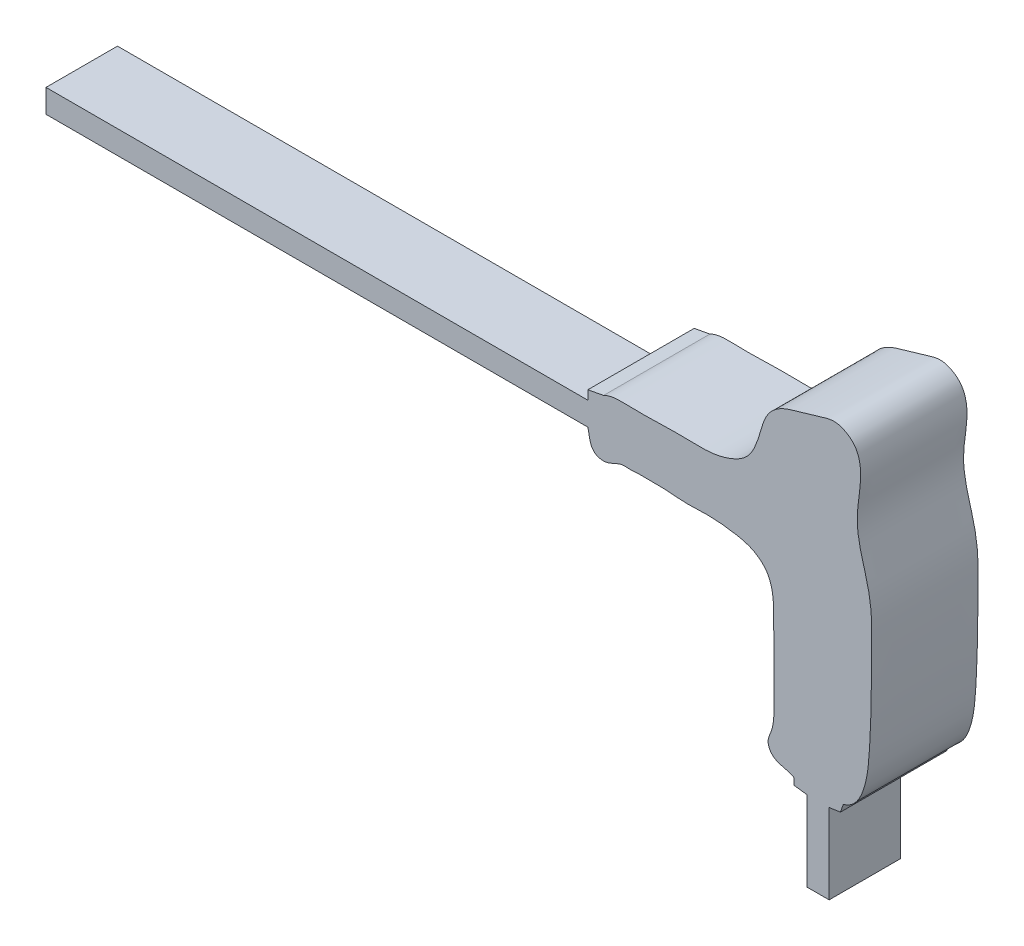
from build123d import *

# Parameters (mm, degrees)
BOSS_EXTRU_1_DEPTH      = 8.7
BOSS_EXTRU_1_DEPTH_BACK = 8.7
ESQUISSE2_W             = 3.624779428
ESQUISSE2_H             = 13.099889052
ESQUISSE2_W_2           = 88.693828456
ESQUISSE2_H_2           = 3.819311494
ENL_V_MAT_EXTRU_1_DEPTH = 5.7


with BuildPart() as part:
    # Esquisse1 → Boss.-Extru.1 (new, two sides: drawn at the far end of the back side and taken through both)
    with BuildSketch(Plane.XY.offset(-BOSS_EXTRU_1_DEPTH_BACK)):
        with BuildLine():
            Line((93.046595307, 50.808263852), (4.352766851, 50.808263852))
            Line((4.352766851, 50.808263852), (4.352766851, 46.988952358))
            Line((4.352766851, 46.988952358), (93.046595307, 46.988952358))
            add(Edge.make_bspline(
                [(93.046595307, 46.988952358), (93.247433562, 46.073835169), (93.333303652, 43.952970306), (95.69952302, 43.294273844), (97.174486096, 43.894564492), (98.517105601, 44.583492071), (99.797251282, 44.411384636), (101.264185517, 44.566123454), (103.261635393, 44.478969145), (105.9365003, 44.561998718), (108.675461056, 44.184987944), (111.422540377, 44.352638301), (114.114693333, 44.349958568), (117.004597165, 43.989657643), (120.078216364, 43.347813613), (122.538705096, 41.365078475), (123.37457678, 38.527598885), (123.511262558, 35.528978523), (123.401119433, 32.548113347), (123.583566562, 29.80194466), (123.486814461, 27.799935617), (123.514838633, 25.850858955), (123.524766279, 23.676108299), (123.544853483, 21.243319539), (123.217470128, 19.033941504), (122.458824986, 17.615339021), (122.621061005, 16.374460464), (123.806626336, 14.711219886), (125.787848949, 14.818347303), (126.767046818, 14.185406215)],
                knots=[0, 0, 0, 0, 0.052214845, 0.077275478, 0.104597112, 0.127834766, 0.147881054, 0.164899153, 0.198890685, 0.243779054, 0.293581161, 0.331207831, 0.375957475, 0.422905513, 0.471271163, 0.525960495, 0.564059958, 0.609940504, 0.670320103, 0.707430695, 0.742198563, 0.766656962, 0.80121518, 0.846864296, 0.88364367, 0.907872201, 0.921373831, 0.941822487, 1, 1, 1, 1], degree=3))
            Line((126.767046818, 14.185406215), (126.767046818, 13.093271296))
            Line((126.767046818, 13.093271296), (128.905366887, 12.825584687))
            Line((128.905366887, 12.825584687), (128.905366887, -0.274304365))
            Line((128.905366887, -0.274304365), (132.530146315, -0.274304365))
            Line((132.530146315, -0.274304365), (132.530146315, 12.825584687))
            Line((132.530146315, 12.825584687), (134.379617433, 13.093271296))
            Line((134.379617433, 13.093271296), (134.848525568, 14.440362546))
            add(Edge.make_bspline(
                [(95.610999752, 52.775251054), (96.682101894, 53.351994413), (98.457374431, 53.414134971), (101.462662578, 53.275760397), (104.586961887, 53.37646396), (108.10973621, 53.45714626), (111.067538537, 53.338203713), (113.776029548, 53.437321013), (116.520614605, 54.128367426), (119.154303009, 55.565464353), (120.606811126, 58.132265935), (121.332411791, 60.656204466), (122.085552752, 63.140245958), (123.763996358, 65.115441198), (126.755424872, 66.355263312), (130.144484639, 67.057998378), (133.228213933, 68.271381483), (135.406949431, 67.431619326), (136.956989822, 66.201991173), (137.710800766, 64.022070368), (137.729537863, 61.258260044), (137.24165585, 58.416532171), (137.045514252, 55.201682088), (137.632338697, 51.54744135), (138.865216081, 47.835316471), (139.592453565, 43.337484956), (139.468211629, 39.487101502), (139.496456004, 35.606736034), (139.444391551, 31.906701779), (139.320359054, 27.932531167), (139.100680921, 23.256393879), (138.623598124, 18.405681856), (136.736418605, 14.92310285), (134.848525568, 14.440362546)],
                knots=[0, 0, 0, 0, 0.035078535, 0.05071299, 0.088734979, 0.126756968, 0.15428397, 0.175774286, 0.206096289, 0.237223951, 0.260359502, 0.290422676, 0.314808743, 0.33580201, 0.364173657, 0.407431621, 0.440029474, 0.455389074, 0.473826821, 0.496547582, 0.520096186, 0.554769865, 0.581136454, 0.61438316, 0.662731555, 0.695991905, 0.747656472, 0.77559728, 0.810104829, 0.856397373, 0.892495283, 0.947607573, 1, 1, 1, 1], degree=3))
            Line((95.610999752, 52.775251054), (93.046595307, 52.299139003))
            Line((93.046595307, 52.299139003), (93.046595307, 50.808263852))
        make_face()
    extrude(amount=BOSS_EXTRU_1_DEPTH + BOSS_EXTRU_1_DEPTH_BACK)

    # Esquisse2 → Enl_v. mat.-Extru.1 (cut)
    with BuildSketch(Plane(origin=(0, 0, -8.7), x_dir=(-1, 0, 0), z_dir=(0, 0, -1))):
        with Locations((-130.717756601, 6.275640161)):
            Rectangle(ESQUISSE2_W, ESQUISSE2_H)
        with Locations((-48.699681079, 48.898608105)):
            Rectangle(ESQUISSE2_W_2, ESQUISSE2_H_2)
    extrude(amount=-ENL_V_MAT_EXTRU_1_DEPTH, mode=Mode.SUBTRACT)


solid = part.part
